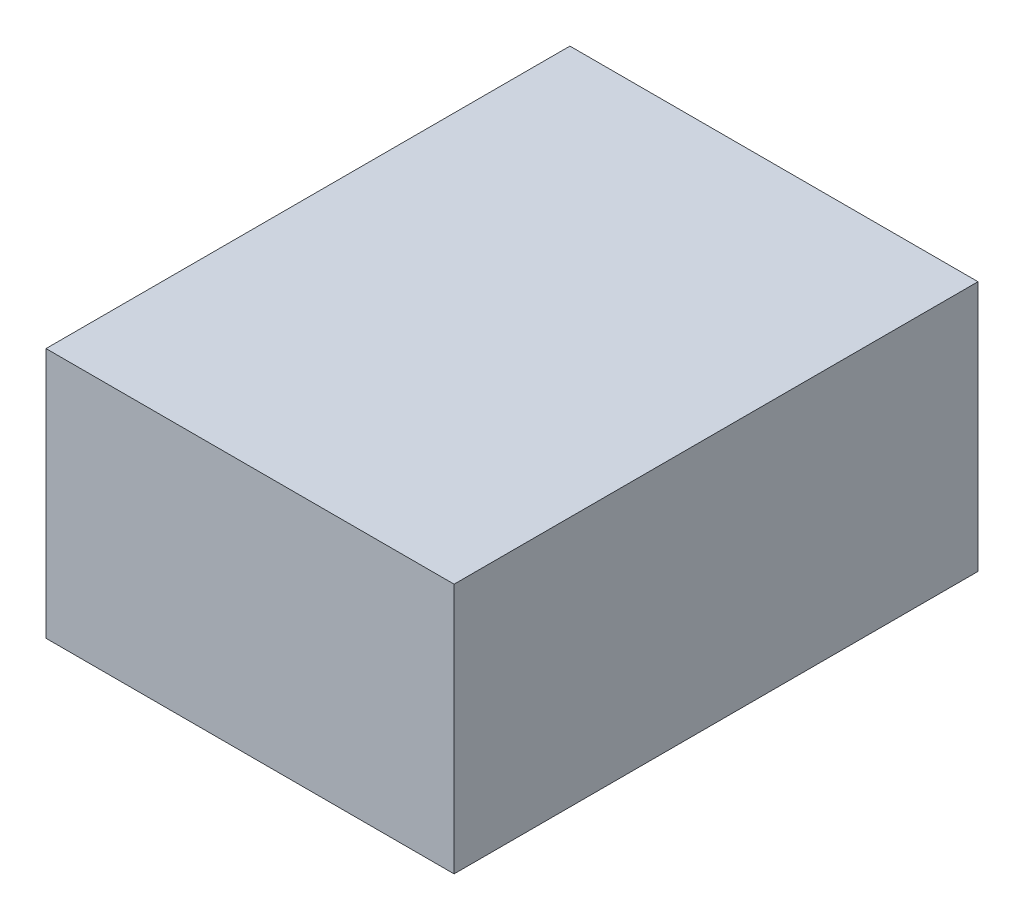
ISO-10303-21;
HEADER;
FILE_DESCRIPTION(('STEP AP214'),'2;1');
FILE_NAME('part.step','',(''),(''),'','','');
FILE_SCHEMA(('AUTOMOTIVE_DESIGN { 1 0 10303 214 1 1 1 1 }'));
ENDSEC;
DATA;
#1=APPLICATION_CONTEXT('core data for automotive mechanical design processes');
#2=APPLICATION_PROTOCOL_DEFINITION('international standard','automotive_design',2000,#1);
#3=PRODUCT_CONTEXT('',#1,'mechanical');
#4=PRODUCT('Part','Part','',(#3));
#5=PRODUCT_RELATED_PRODUCT_CATEGORY('part','',(#4));
#6=PRODUCT_DEFINITION_FORMATION('','',#4);
#7=PRODUCT_DEFINITION_CONTEXT('part definition',#1,'design');
#8=PRODUCT_DEFINITION('design','',#6,#7);
#9=PRODUCT_DEFINITION_SHAPE('','',#8);
#10=(LENGTH_UNIT() NAMED_UNIT(*) SI_UNIT(.MILLI.,.METRE.));
#11=(NAMED_UNIT(*) PLANE_ANGLE_UNIT() SI_UNIT($,.RADIAN.));
#12=(NAMED_UNIT(*) SI_UNIT($,.STERADIAN.) SOLID_ANGLE_UNIT());
#13=UNCERTAINTY_MEASURE_WITH_UNIT(LENGTH_MEASURE(1.E-05),#10,'distance_accuracy_value','');
#14=(GEOMETRIC_REPRESENTATION_CONTEXT(3) GLOBAL_UNCERTAINTY_ASSIGNED_CONTEXT((#13)) GLOBAL_UNIT_ASSIGNED_CONTEXT((#10,
#11,#12)) REPRESENTATION_CONTEXT('',''));
#15=CARTESIAN_POINT('',(0.,0.,0.));
#16=DIRECTION('',(0.,0.,1.));
#17=DIRECTION('',(1.,0.,0.));
#18=AXIS2_PLACEMENT_3D('',#15,#16,#17);
#19=CARTESIAN_POINT('',(0.,46.8536169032,0.));
#20=DIRECTION('',(1.,0.,0.));
#21=DIRECTION('',(0.,0.,-1.));
#22=AXIS2_PLACEMENT_3D('',#19,#20,#21);
#23=PLANE('',#22);
#24=DIRECTION('',(0.,0.,1.));
#25=VECTOR('',#24,1.);
#26=CARTESIAN_POINT('',(0.,0.,0.));
#27=LINE('',#26,#25);
#28=CARTESIAN_POINT('',(0.,0.,0.));
#29=VERTEX_POINT('',#28);
#30=CARTESIAN_POINT('',(0.,0.,97.825637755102));
#31=VERTEX_POINT('',#30);
#32=EDGE_CURVE('E75',#29,#31,#27,.T.);
#33=ORIENTED_EDGE('',*,*,#32,.T.);
#34=DIRECTION('',(0.,-1.,0.));
#35=VECTOR('',#34,1.);
#36=CARTESIAN_POINT('',(0.,46.8536169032,97.825637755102));
#37=LINE('',#36,#35);
#38=CARTESIAN_POINT('',(0.,46.8536169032,97.825637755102));
#39=VERTEX_POINT('',#38);
#40=EDGE_CURVE('E11',#39,#31,#37,.T.);
#41=ORIENTED_EDGE('',*,*,#40,.F.);
#42=DIRECTION('',(0.,0.,1.));
#43=VECTOR('',#42,1.);
#44=CARTESIAN_POINT('',(0.,46.8536169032,0.));
#45=LINE('',#44,#43);
#46=CARTESIAN_POINT('',(0.,46.8536169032,0.));
#47=VERTEX_POINT('',#46);
#48=EDGE_CURVE('E93',#47,#39,#45,.T.);
#49=ORIENTED_EDGE('',*,*,#48,.F.);
#50=DIRECTION('',(0.,-1.,0.));
#51=VECTOR('',#50,1.);
#52=CARTESIAN_POINT('',(0.,46.8536169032,0.));
#53=LINE('',#52,#51);
#54=EDGE_CURVE('E87',#47,#29,#53,.T.);
#55=ORIENTED_EDGE('',*,*,#54,.T.);
#56=EDGE_LOOP('',(#33,#41,#49,#55));
#57=FACE_BOUND('',#56,.T.);
#58=ADVANCED_FACE('F31',(#57),#23,.F.);
#59=CARTESIAN_POINT('',(0.,46.8536169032,97.825637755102));
#60=DIRECTION('',(0.,0.,-1.));
#61=DIRECTION('',(-1.,0.,0.));
#62=AXIS2_PLACEMENT_3D('',#59,#60,#61);
#63=PLANE('',#62);
#64=DIRECTION('',(1.,0.,0.));
#65=VECTOR('',#64,1.);
#66=CARTESIAN_POINT('',(0.,0.,97.825637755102));
#67=LINE('',#66,#65);
#68=CARTESIAN_POINT('',(76.2,0.,97.825637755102));
#69=VERTEX_POINT('',#68);
#70=EDGE_CURVE('E71',#31,#69,#67,.T.);
#71=ORIENTED_EDGE('',*,*,#70,.T.);
#72=DIRECTION('',(0.,-1.,0.));
#73=VECTOR('',#72,1.);
#74=CARTESIAN_POINT('',(76.2,46.8536169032,97.825637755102));
#75=LINE('',#74,#73);
#76=CARTESIAN_POINT('',(76.2,46.8536169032,97.825637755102));
#77=VERTEX_POINT('',#76);
#78=EDGE_CURVE('E38',#77,#69,#75,.T.);
#79=ORIENTED_EDGE('',*,*,#78,.F.);
#80=DIRECTION('',(1.,0.,0.));
#81=VECTOR('',#80,1.);
#82=CARTESIAN_POINT('',(0.,46.8536169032,97.825637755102));
#83=LINE('',#82,#81);
#84=EDGE_CURVE('E83',#39,#77,#83,.T.);
#85=ORIENTED_EDGE('',*,*,#84,.F.);
#86=ORIENTED_EDGE('',*,*,#40,.T.);
#87=EDGE_LOOP('',(#71,#79,#85,#86));
#88=FACE_BOUND('',#87,.T.);
#89=ADVANCED_FACE('F82',(#88),#63,.F.);
#90=CARTESIAN_POINT('',(76.2,46.8536169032,0.));
#91=DIRECTION('',(-1.,0.,0.));
#92=DIRECTION('',(0.,0.,1.));
#93=AXIS2_PLACEMENT_3D('',#90,#91,#92);
#94=PLANE('',#93);
#95=DIRECTION('',(0.,0.,-1.));
#96=VECTOR('',#95,1.);
#97=CARTESIAN_POINT('',(76.2,0.,0.));
#98=LINE('',#97,#96);
#99=CARTESIAN_POINT('',(76.2,0.,0.));
#100=VERTEX_POINT('',#99);
#101=EDGE_CURVE('E76',#69,#100,#98,.T.);
#102=ORIENTED_EDGE('',*,*,#101,.T.);
#103=DIRECTION('',(0.,-1.,0.));
#104=VECTOR('',#103,1.);
#105=CARTESIAN_POINT('',(76.2,46.8536169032,0.));
#106=LINE('',#105,#104);
#107=CARTESIAN_POINT('',(76.2,46.8536169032,0.));
#108=VERTEX_POINT('',#107);
#109=EDGE_CURVE('E99',#108,#100,#106,.T.);
#110=ORIENTED_EDGE('',*,*,#109,.F.);
#111=DIRECTION('',(0.,0.,-1.));
#112=VECTOR('',#111,1.);
#113=CARTESIAN_POINT('',(76.2,46.8536169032,0.));
#114=LINE('',#113,#112);
#115=EDGE_CURVE('E50',#77,#108,#114,.T.);
#116=ORIENTED_EDGE('',*,*,#115,.F.);
#117=ORIENTED_EDGE('',*,*,#78,.T.);
#118=EDGE_LOOP('',(#102,#110,#116,#117));
#119=FACE_BOUND('',#118,.T.);
#120=ADVANCED_FACE('F102',(#119),#94,.F.);
#121=CARTESIAN_POINT('',(0.,46.8536169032,0.));
#122=DIRECTION('',(0.,0.,1.));
#123=DIRECTION('',(1.,0.,0.));
#124=AXIS2_PLACEMENT_3D('',#121,#122,#123);
#125=PLANE('',#124);
#126=DIRECTION('',(-1.,0.,0.));
#127=VECTOR('',#126,1.);
#128=CARTESIAN_POINT('',(0.,0.,0.));
#129=LINE('',#128,#127);
#130=EDGE_CURVE('E91',#100,#29,#129,.T.);
#131=ORIENTED_EDGE('',*,*,#130,.T.);
#132=ORIENTED_EDGE('',*,*,#54,.F.);
#133=DIRECTION('',(-1.,0.,0.));
#134=VECTOR('',#133,1.);
#135=CARTESIAN_POINT('',(0.,46.8536169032,0.));
#136=LINE('',#135,#134);
#137=EDGE_CURVE('E45',#108,#47,#136,.T.);
#138=ORIENTED_EDGE('',*,*,#137,.F.);
#139=ORIENTED_EDGE('',*,*,#109,.T.);
#140=EDGE_LOOP('',(#131,#132,#138,#139));
#141=FACE_BOUND('',#140,.T.);
#142=ADVANCED_FACE('F104',(#141),#125,.F.);
#143=CARTESIAN_POINT('',(0.,46.8536169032,97.825637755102));
#144=DIRECTION('',(0.,1.,0.));
#145=DIRECTION('',(0.,0.,1.));
#146=AXIS2_PLACEMENT_3D('',#143,#144,#145);
#147=PLANE('',#146);
#148=ORIENTED_EDGE('',*,*,#48,.T.);
#149=ORIENTED_EDGE('',*,*,#84,.T.);
#150=ORIENTED_EDGE('',*,*,#115,.T.);
#151=ORIENTED_EDGE('',*,*,#137,.T.);
#152=EDGE_LOOP('',(#148,#149,#150,#151));
#153=FACE_BOUND('',#152,.T.);
#154=ADVANCED_FACE('F105',(#153),#147,.T.);
#155=CARTESIAN_POINT('',(0.,0.,97.825637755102));
#156=DIRECTION('',(0.,1.,0.));
#157=DIRECTION('',(0.,0.,1.));
#158=AXIS2_PLACEMENT_3D('',#155,#156,#157);
#159=PLANE('',#158);
#160=ORIENTED_EDGE('',*,*,#32,.F.);
#161=ORIENTED_EDGE('',*,*,#130,.F.);
#162=ORIENTED_EDGE('',*,*,#101,.F.);
#163=ORIENTED_EDGE('',*,*,#70,.F.);
#164=EDGE_LOOP('',(#160,#161,#162,#163));
#165=FACE_BOUND('',#164,.T.);
#166=ADVANCED_FACE('F72',(#165),#159,.F.);
#167=CLOSED_SHELL('',(#58,#89,#120,#142,#154,#166));
#168=MANIFOLD_SOLID_BREP('B2',#167);
#169=ADVANCED_BREP_SHAPE_REPRESENTATION('',(#18,#168),#14);
#170=SHAPE_DEFINITION_REPRESENTATION(#9,#169);
ENDSEC;
END-ISO-10303-21;
